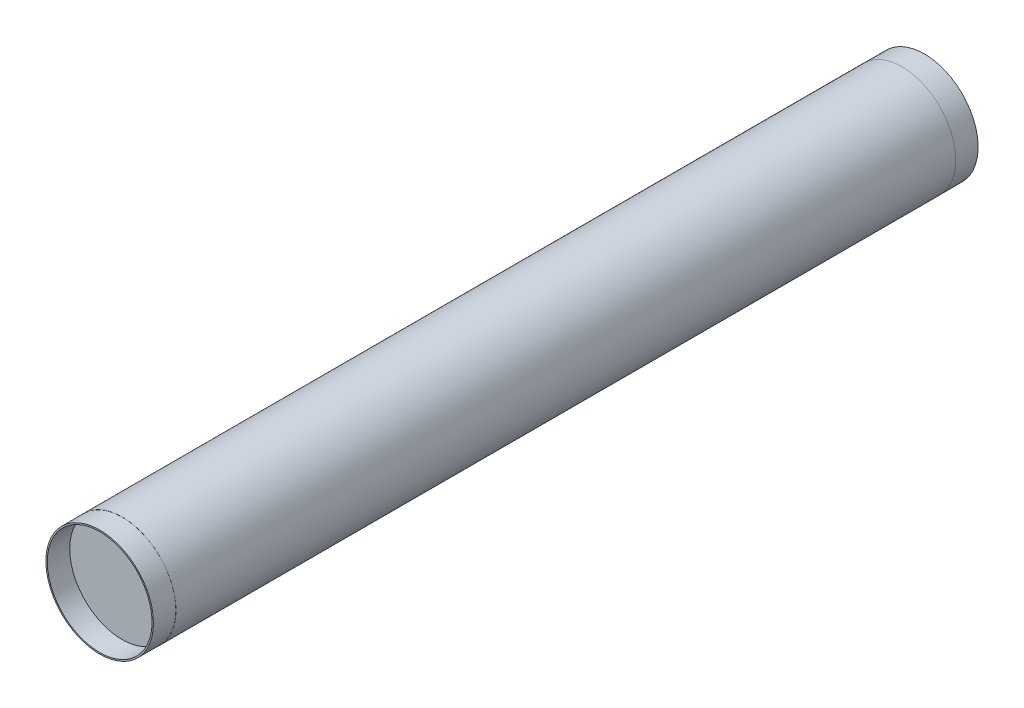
ISO-10303-21;
HEADER;
FILE_DESCRIPTION(('STEP AP214'),'2;1');
FILE_NAME('part.step','',(''),(''),'','','');
FILE_SCHEMA(('AUTOMOTIVE_DESIGN { 1 0 10303 214 1 1 1 1 }'));
ENDSEC;
DATA;
#1=APPLICATION_CONTEXT('core data for automotive mechanical design processes');
#2=APPLICATION_PROTOCOL_DEFINITION('international standard','automotive_design',2000,#1);
#3=PRODUCT_CONTEXT('',#1,'mechanical');
#4=PRODUCT('Part','Part','',(#3));
#5=PRODUCT_RELATED_PRODUCT_CATEGORY('part','',(#4));
#6=PRODUCT_DEFINITION_FORMATION('','',#4);
#7=PRODUCT_DEFINITION_CONTEXT('part definition',#1,'design');
#8=PRODUCT_DEFINITION('design','',#6,#7);
#9=PRODUCT_DEFINITION_SHAPE('','',#8);
#10=(LENGTH_UNIT() NAMED_UNIT(*) SI_UNIT(.MILLI.,.METRE.));
#11=(NAMED_UNIT(*) PLANE_ANGLE_UNIT() SI_UNIT($,.RADIAN.));
#12=(NAMED_UNIT(*) SI_UNIT($,.STERADIAN.) SOLID_ANGLE_UNIT());
#13=UNCERTAINTY_MEASURE_WITH_UNIT(LENGTH_MEASURE(1.E-05),#10,'distance_accuracy_value','');
#14=(GEOMETRIC_REPRESENTATION_CONTEXT(3) GLOBAL_UNCERTAINTY_ASSIGNED_CONTEXT((#13)) GLOBAL_UNIT_ASSIGNED_CONTEXT((#10,
#11,#12)) REPRESENTATION_CONTEXT('',''));
#15=CARTESIAN_POINT('',(0.,0.,0.));
#16=DIRECTION('',(0.,0.,1.));
#17=DIRECTION('',(1.,0.,0.));
#18=AXIS2_PLACEMENT_3D('',#15,#16,#17);
#19=CARTESIAN_POINT('',(0.,0.,609.6));
#20=DIRECTION('',(0.,0.,-1.));
#21=DIRECTION('',(-1.,0.,0.));
#22=AXIS2_PLACEMENT_3D('',#19,#20,#21);
#23=CYLINDRICAL_SURFACE('',#22,76.327);
#24=CARTESIAN_POINT('',(0.,0.,577.85));
#25=DIRECTION('',(0.,0.,1.));
#26=DIRECTION('',(1.,0.,0.));
#27=AXIS2_PLACEMENT_3D('',#24,#25,#26);
#28=CIRCLE('',#27,76.327);
#29=CARTESIAN_POINT('',(-76.327,0.,577.85));
#30=VERTEX_POINT('',#29);
#31=EDGE_CURVE('E124',#30,#30,#28,.T.);
#32=CARTESIAN_POINT('',(0.,0.,-527.05));
#33=DIRECTION('',(0.,0.,-1.));
#34=DIRECTION('',(-1.,0.,0.));
#35=AXIS2_PLACEMENT_3D('',#32,#33,#34);
#36=CIRCLE('',#35,76.327);
#37=CARTESIAN_POINT('',(-76.327,0.,-527.05));
#38=VERTEX_POINT('',#37);
#39=EDGE_CURVE('E115',#38,#38,#36,.T.);
#40=CARTESIAN_POINT('',(-76.327,0.,577.85));
#41=CARTESIAN_POINT('',(-76.327,0.,566.340625));
#42=CARTESIAN_POINT('',(-76.327,0.,554.83125));
#43=CARTESIAN_POINT('',(-76.327,0.,531.8125));
#44=CARTESIAN_POINT('',(-76.327,0.,520.303125));
#45=CARTESIAN_POINT('',(-76.327,0.,497.284375));
#46=CARTESIAN_POINT('',(-76.327,0.,485.775));
#47=CARTESIAN_POINT('',(-76.327,0.,462.75625));
#48=CARTESIAN_POINT('',(-76.327,0.,451.246875));
#49=CARTESIAN_POINT('',(-76.327,0.,428.228125));
#50=CARTESIAN_POINT('',(-76.327,0.,416.71875));
#51=CARTESIAN_POINT('',(-76.327,0.,393.7));
#52=CARTESIAN_POINT('',(-76.327,0.,382.190625));
#53=CARTESIAN_POINT('',(-76.327,0.,359.171875));
#54=CARTESIAN_POINT('',(-76.327,0.,347.6625));
#55=CARTESIAN_POINT('',(-76.327,0.,324.64375));
#56=CARTESIAN_POINT('',(-76.327,0.,313.134375));
#57=CARTESIAN_POINT('',(-76.327,0.,290.115625));
#58=CARTESIAN_POINT('',(-76.327,0.,278.60625));
#59=CARTESIAN_POINT('',(-76.327,0.,255.5875));
#60=CARTESIAN_POINT('',(-76.327,0.,244.078125));
#61=CARTESIAN_POINT('',(-76.327,0.,221.059375));
#62=CARTESIAN_POINT('',(-76.327,0.,209.55));
#63=CARTESIAN_POINT('',(-76.327,0.,186.53125));
#64=CARTESIAN_POINT('',(-76.327,0.,175.021875));
#65=CARTESIAN_POINT('',(-76.327,0.,152.003125));
#66=CARTESIAN_POINT('',(-76.327,0.,140.49375));
#67=CARTESIAN_POINT('',(-76.327,0.,117.475));
#68=CARTESIAN_POINT('',(-76.327,0.,105.965625));
#69=CARTESIAN_POINT('',(-76.327,0.,82.9468749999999));
#70=CARTESIAN_POINT('',(-76.327,0.,71.4374999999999));
#71=CARTESIAN_POINT('',(-76.327,0.,48.4187499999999));
#72=CARTESIAN_POINT('',(-76.327,0.,36.9093749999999));
#73=CARTESIAN_POINT('',(-76.327,0.,13.8906249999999));
#74=CARTESIAN_POINT('',(-76.327,0.,2.38124999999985));
#75=CARTESIAN_POINT('',(-76.327,0.,-20.6375000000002));
#76=CARTESIAN_POINT('',(-76.327,0.,-32.1468750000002));
#77=CARTESIAN_POINT('',(-76.327,0.,-55.1656250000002));
#78=CARTESIAN_POINT('',(-76.327,0.,-66.6750000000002));
#79=CARTESIAN_POINT('',(-76.327,0.,-89.6937500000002));
#80=CARTESIAN_POINT('',(-76.327,0.,-101.203125));
#81=CARTESIAN_POINT('',(-76.327,0.,-124.221875));
#82=CARTESIAN_POINT('',(-76.327,0.,-135.73125));
#83=CARTESIAN_POINT('',(-76.327,0.,-158.75));
#84=CARTESIAN_POINT('',(-76.327,0.,-170.259375));
#85=CARTESIAN_POINT('',(-76.327,0.,-193.278125));
#86=CARTESIAN_POINT('',(-76.327,0.,-204.7875));
#87=CARTESIAN_POINT('',(-76.327,0.,-227.80625));
#88=CARTESIAN_POINT('',(-76.327,0.,-239.315625));
#89=CARTESIAN_POINT('',(-76.327,0.,-262.334375));
#90=CARTESIAN_POINT('',(-76.327,0.,-273.84375));
#91=CARTESIAN_POINT('',(-76.327,0.,-296.8625));
#92=CARTESIAN_POINT('',(-76.327,0.,-308.371875));
#93=CARTESIAN_POINT('',(-76.327,0.,-331.390625));
#94=CARTESIAN_POINT('',(-76.327,0.,-342.9));
#95=CARTESIAN_POINT('',(-76.327,0.,-365.91875));
#96=CARTESIAN_POINT('',(-76.327,0.,-377.428125));
#97=CARTESIAN_POINT('',(-76.327,0.,-400.446875));
#98=CARTESIAN_POINT('',(-76.327,0.,-411.95625));
#99=CARTESIAN_POINT('',(-76.327,0.,-434.975));
#100=CARTESIAN_POINT('',(-76.327,0.,-446.484375));
#101=CARTESIAN_POINT('',(-76.327,0.,-469.503125));
#102=CARTESIAN_POINT('',(-76.327,0.,-481.0125));
#103=CARTESIAN_POINT('',(-76.327,0.,-504.03125));
#104=CARTESIAN_POINT('',(-76.327,0.,-515.540625));
#105=CARTESIAN_POINT('',(-76.327,0.,-527.05));
#106=B_SPLINE_CURVE_WITH_KNOTS('',3,(#40,#41,#42,#43,#44,#45,#46,#47,#48,#49,#50,#51,#52,#53,
#54,#55,#56,#57,#58,#59,#60,#61,#62,#63,#64,#65,#66,#67,#68,#69,#70,#71,#72,#73,#74,#75,#76,#77,
#78,#79,#80,#81,#82,#83,#84,#85,#86,#87,#88,#89,#90,#91,#92,#93,#94,#95,#96,#97,#98,#99,#100,
#101,#102,#103,#104,#105),.UNSPECIFIED.,.F.,.F.,(4,2,2,2,2,2,2,2,2,2,2,2,2,2,2,2,2,2,2,2,2,2,2,
2,2,2,2,2,2,2,2,2,4),(0.,34.5281249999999,69.0562499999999,103.584375,138.1125,172.640625,
207.16875,241.696875,276.225,310.753125,345.28125,379.809375,414.3375,448.865625,483.39375,
517.921875,552.45,586.978125,621.50625,656.034375,690.5625,725.090625,759.61875,794.146875,
828.675,863.203125,897.73125,932.259375,966.7875,1001.315625,1035.84375,1070.371875,1104.9),.UNSPECIFIED.);
#107=EDGE_CURVE('BSEAM112',#30,#38,#106,.T.);
#108=ORIENTED_EDGE('',*,*,#31,.F.);
#109=ORIENTED_EDGE('',*,*,#39,.F.);
#110=ORIENTED_EDGE('',*,*,#107,.T.);
#111=ORIENTED_EDGE('',*,*,#107,.F.);
#112=EDGE_LOOP('',(#108,#110,#109,#111));
#113=FACE_BOUND('',#112,.T.);
#114=ADVANCED_FACE('F112',(#113),#23,.T.);
#115=CARTESIAN_POINT('',(1643.11629233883,116.289931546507,-558.8));
#116=DIRECTION('',(0.,0.,-1.));
#117=DIRECTION('',(-1.,0.,0.));
#118=AXIS2_PLACEMENT_3D('',#115,#116,#117);
#119=PLANE('',#118);
#120=CARTESIAN_POINT('',(0.,0.,-558.8));
#121=DIRECTION('',(0.,0.,-1.));
#122=DIRECTION('',(-1.,0.,0.));
#123=AXIS2_PLACEMENT_3D('',#120,#121,#122);
#124=CIRCLE('',#123,74.2188);
#125=CARTESIAN_POINT('',(-74.2188,0.,-558.8));
#126=VERTEX_POINT('',#125);
#127=EDGE_CURVE('E119',#126,#126,#124,.T.);
#128=ORIENTED_EDGE('',*,*,#127,.F.);
#129=EDGE_LOOP('',(#128));
#130=FACE_BOUND('',#129,.T.);
#131=CARTESIAN_POINT('',(0.,0.,-558.8));
#132=DIRECTION('',(0.,0.,-1.));
#133=DIRECTION('',(-1.,0.,0.));
#134=AXIS2_PLACEMENT_3D('',#131,#132,#133);
#135=CIRCLE('',#134,76.2);
#136=CARTESIAN_POINT('',(-76.2,0.,-558.8));
#137=VERTEX_POINT('',#136);
#138=EDGE_CURVE('E138',#137,#137,#135,.T.);
#139=ORIENTED_EDGE('',*,*,#138,.T.);
#140=EDGE_LOOP('',(#139));
#141=FACE_BOUND('',#140,.T.);
#142=ADVANCED_FACE('F151',(#130,#141),#119,.T.);
#143=CARTESIAN_POINT('',(0.,0.,609.6));
#144=DIRECTION('',(0.,0.,1.));
#145=DIRECTION('',(1.,0.,0.));
#146=AXIS2_PLACEMENT_3D('',#143,#144,#145);
#147=PLANE('',#146);
#148=CARTESIAN_POINT('',(0.,0.,609.6));
#149=DIRECTION('',(0.,0.,1.));
#150=DIRECTION('',(1.,0.,0.));
#151=AXIS2_PLACEMENT_3D('',#148,#149,#150);
#152=CIRCLE('',#151,74.2188);
#153=CARTESIAN_POINT('',(-74.2188,0.,609.6));
#154=VERTEX_POINT('',#153);
#155=EDGE_CURVE('E12',#154,#154,#152,.T.);
#156=ORIENTED_EDGE('',*,*,#155,.F.);
#157=EDGE_LOOP('',(#156));
#158=FACE_BOUND('',#157,.T.);
#159=CARTESIAN_POINT('',(0.,0.,609.6));
#160=DIRECTION('',(0.,0.,1.));
#161=DIRECTION('',(1.,0.,0.));
#162=AXIS2_PLACEMENT_3D('',#159,#160,#161);
#163=CIRCLE('',#162,76.2);
#164=CARTESIAN_POINT('',(76.2,0.,609.6));
#165=VERTEX_POINT('',#164);
#166=EDGE_CURVE('E127',#165,#165,#163,.T.);
#167=ORIENTED_EDGE('',*,*,#166,.T.);
#168=EDGE_LOOP('',(#167));
#169=FACE_BOUND('',#168,.T.);
#170=ADVANCED_FACE('F156',(#158,#169),#147,.T.);
#171=CARTESIAN_POINT('',(0.,0.,609.6));
#172=DIRECTION('',(0.,0.,-1.));
#173=DIRECTION('',(-1.,0.,0.));
#174=AXIS2_PLACEMENT_3D('',#171,#172,#173);
#175=CYLINDRICAL_SURFACE('',#174,74.2188);
#176=CARTESIAN_POINT('',(-74.2188,0.,609.6));
#177=CARTESIAN_POINT('',(-74.2188,0.,597.429166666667));
#178=CARTESIAN_POINT('',(-74.2188,0.,585.258333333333));
#179=CARTESIAN_POINT('',(-74.2188,0.,560.916666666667));
#180=CARTESIAN_POINT('',(-74.2188,0.,548.745833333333));
#181=CARTESIAN_POINT('',(-74.2188,0.,524.404166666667));
#182=CARTESIAN_POINT('',(-74.2188,0.,512.233333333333));
#183=CARTESIAN_POINT('',(-74.2188,0.,487.891666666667));
#184=CARTESIAN_POINT('',(-74.2188,0.,475.720833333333));
#185=CARTESIAN_POINT('',(-74.2188,0.,451.379166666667));
#186=CARTESIAN_POINT('',(-74.2188,0.,439.208333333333));
#187=CARTESIAN_POINT('',(-74.2188,0.,414.866666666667));
#188=CARTESIAN_POINT('',(-74.2188,0.,402.695833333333));
#189=CARTESIAN_POINT('',(-74.2188,0.,378.354166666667));
#190=CARTESIAN_POINT('',(-74.2188,0.,366.183333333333));
#191=CARTESIAN_POINT('',(-74.2188,0.,341.841666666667));
#192=CARTESIAN_POINT('',(-74.2188,0.,329.670833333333));
#193=CARTESIAN_POINT('',(-74.2188,0.,305.329166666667));
#194=CARTESIAN_POINT('',(-74.2188,0.,293.158333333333));
#195=CARTESIAN_POINT('',(-74.2188,0.,268.816666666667));
#196=CARTESIAN_POINT('',(-74.2188,0.,256.645833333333));
#197=CARTESIAN_POINT('',(-74.2188,0.,232.304166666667));
#198=CARTESIAN_POINT('',(-74.2188,0.,220.133333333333));
#199=CARTESIAN_POINT('',(-74.2188,0.,195.791666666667));
#200=CARTESIAN_POINT('',(-74.2188,0.,183.620833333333));
#201=CARTESIAN_POINT('',(-74.2188,0.,159.279166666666));
#202=CARTESIAN_POINT('',(-74.2188,0.,147.108333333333));
#203=CARTESIAN_POINT('',(-74.2188,0.,122.766666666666));
#204=CARTESIAN_POINT('',(-74.2188,0.,110.595833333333));
#205=CARTESIAN_POINT('',(-74.2188,0.,86.2541666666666));
#206=CARTESIAN_POINT('',(-74.2188,0.,74.0833333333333));
#207=CARTESIAN_POINT('',(-74.2188,0.,49.7416666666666));
#208=CARTESIAN_POINT('',(-74.2188,0.,37.5708333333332));
#209=CARTESIAN_POINT('',(-74.2188,0.,13.2291666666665));
#210=CARTESIAN_POINT('',(-74.2188,0.,1.05833333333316));
#211=CARTESIAN_POINT('',(-74.2188,0.,-23.2833333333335));
#212=CARTESIAN_POINT('',(-74.2188,0.,-35.4541666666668));
#213=CARTESIAN_POINT('',(-74.2188,0.,-59.7958333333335));
#214=CARTESIAN_POINT('',(-74.2188,0.,-71.9666666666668));
#215=CARTESIAN_POINT('',(-74.2188,0.,-96.3083333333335));
#216=CARTESIAN_POINT('',(-74.2188,0.,-108.479166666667));
#217=CARTESIAN_POINT('',(-74.2188,0.,-132.820833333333));
#218=CARTESIAN_POINT('',(-74.2188,0.,-144.991666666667));
#219=CARTESIAN_POINT('',(-74.2188,0.,-169.333333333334));
#220=CARTESIAN_POINT('',(-74.2188,0.,-181.504166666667));
#221=CARTESIAN_POINT('',(-74.2188,0.,-205.845833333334));
#222=CARTESIAN_POINT('',(-74.2188,0.,-218.016666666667));
#223=CARTESIAN_POINT('',(-74.2188,0.,-242.358333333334));
#224=CARTESIAN_POINT('',(-74.2188,0.,-254.529166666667));
#225=CARTESIAN_POINT('',(-74.2188,0.,-278.870833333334));
#226=CARTESIAN_POINT('',(-74.2188,0.,-291.041666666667));
#227=CARTESIAN_POINT('',(-74.2188,0.,-315.383333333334));
#228=CARTESIAN_POINT('',(-74.2188,0.,-327.554166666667));
#229=CARTESIAN_POINT('',(-74.2188,0.,-351.895833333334));
#230=CARTESIAN_POINT('',(-74.2188,0.,-364.066666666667));
#231=CARTESIAN_POINT('',(-74.2188,0.,-388.408333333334));
#232=CARTESIAN_POINT('',(-74.2188,0.,-400.579166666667));
#233=CARTESIAN_POINT('',(-74.2188,0.,-424.920833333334));
#234=CARTESIAN_POINT('',(-74.2188,0.,-437.091666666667));
#235=CARTESIAN_POINT('',(-74.2188,0.,-461.433333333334));
#236=CARTESIAN_POINT('',(-74.2188,0.,-473.604166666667));
#237=CARTESIAN_POINT('',(-74.2188,0.,-497.945833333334));
#238=CARTESIAN_POINT('',(-74.2188,0.,-510.116666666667));
#239=CARTESIAN_POINT('',(-74.2188,0.,-534.458333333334));
#240=CARTESIAN_POINT('',(-74.2188,0.,-546.629166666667));
#241=CARTESIAN_POINT('',(-74.2188,0.,-558.8));
#242=B_SPLINE_CURVE_WITH_KNOTS('',3,(#176,#177,#178,#179,#180,#181,#182,#183,#184,#185,#186,
#187,#188,#189,#190,#191,#192,#193,#194,#195,#196,#197,#198,#199,#200,#201,#202,#203,#204,#205,
#206,#207,#208,#209,#210,#211,#212,#213,#214,#215,#216,#217,#218,#219,#220,#221,#222,#223,#224,
#225,#226,#227,#228,#229,#230,#231,#232,#233,#234,#235,#236,#237,#238,#239,#240,#241),
.UNSPECIFIED.,.F.,.F.,(4,2,2,2,2,2,2,2,2,2,2,2,2,2,2,2,2,2,2,2,2,2,2,2,2,2,2,2,2,2,2,2,4),(0.,
36.5125000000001,73.0250000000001,109.5375,146.05,182.5625,219.075,255.5875,292.1,328.6125,
365.125,401.6375,438.15,474.6625,511.175,547.6875,584.2,620.7125,657.225,693.7375,730.25,
766.7625,803.275,839.7875,876.3,912.8125,949.325,985.8375,1022.35,1058.8625,1095.375,1131.8875,
1168.4),.UNSPECIFIED.);
#243=EDGE_CURVE('BSEAM162',#154,#126,#242,.T.);
#244=ORIENTED_EDGE('',*,*,#155,.T.);
#245=ORIENTED_EDGE('',*,*,#127,.T.);
#246=ORIENTED_EDGE('',*,*,#243,.T.);
#247=ORIENTED_EDGE('',*,*,#243,.F.);
#248=EDGE_LOOP('',(#244,#246,#245,#247));
#249=FACE_BOUND('',#248,.T.);
#250=ADVANCED_FACE('F162',(#249),#175,.F.);
#251=CARTESIAN_POINT('',(0.,0.,577.85));
#252=DIRECTION('',(0.,0.,1.));
#253=DIRECTION('',(1.,0.,0.));
#254=AXIS2_PLACEMENT_3D('',#251,#252,#253);
#255=PLANE('',#254);
#256=CARTESIAN_POINT('',(0.,0.,577.85));
#257=DIRECTION('',(0.,0.,1.));
#258=DIRECTION('',(1.,0.,0.));
#259=AXIS2_PLACEMENT_3D('',#256,#257,#258);
#260=CIRCLE('',#259,76.2);
#261=CARTESIAN_POINT('',(76.2,0.,577.85));
#262=VERTEX_POINT('',#261);
#263=EDGE_CURVE('E130',#262,#262,#260,.T.);
#264=ORIENTED_EDGE('',*,*,#263,.F.);
#265=EDGE_LOOP('',(#264));
#266=FACE_BOUND('',#265,.T.);
#267=ORIENTED_EDGE('',*,*,#31,.T.);
#268=EDGE_LOOP('',(#267));
#269=FACE_BOUND('',#268,.T.);
#270=ADVANCED_FACE('F168',(#266,#269),#255,.T.);
#271=CARTESIAN_POINT('',(0.,0.,577.85));
#272=DIRECTION('',(0.,0.,1.));
#273=DIRECTION('',(1.,0.,0.));
#274=AXIS2_PLACEMENT_3D('',#271,#272,#273);
#275=CYLINDRICAL_SURFACE('',#274,76.2);
#276=ORIENTED_EDGE('',*,*,#263,.T.);
#277=EDGE_LOOP('',(#276));
#278=FACE_BOUND('',#277,.T.);
#279=ORIENTED_EDGE('',*,*,#166,.F.);
#280=EDGE_LOOP('',(#279));
#281=FACE_BOUND('',#280,.T.);
#282=ADVANCED_FACE('F174',(#278,#281),#275,.T.);
#283=CARTESIAN_POINT('',(0.,0.,-527.05));
#284=DIRECTION('',(0.,0.,-1.));
#285=DIRECTION('',(-1.,0.,0.));
#286=AXIS2_PLACEMENT_3D('',#283,#284,#285);
#287=PLANE('',#286);
#288=CARTESIAN_POINT('',(0.,0.,-527.05));
#289=DIRECTION('',(0.,0.,-1.));
#290=DIRECTION('',(-1.,0.,0.));
#291=AXIS2_PLACEMENT_3D('',#288,#289,#290);
#292=CIRCLE('',#291,76.2);
#293=CARTESIAN_POINT('',(-76.2,0.,-527.05));
#294=VERTEX_POINT('',#293);
#295=EDGE_CURVE('E141',#294,#294,#292,.T.);
#296=ORIENTED_EDGE('',*,*,#295,.F.);
#297=EDGE_LOOP('',(#296));
#298=FACE_BOUND('',#297,.T.);
#299=ORIENTED_EDGE('',*,*,#39,.T.);
#300=EDGE_LOOP('',(#299));
#301=FACE_BOUND('',#300,.T.);
#302=ADVANCED_FACE('F148',(#298,#301),#287,.T.);
#303=CARTESIAN_POINT('',(0.,0.,-527.05));
#304=DIRECTION('',(0.,0.,-1.));
#305=DIRECTION('',(-1.,0.,0.));
#306=AXIS2_PLACEMENT_3D('',#303,#304,#305);
#307=CYLINDRICAL_SURFACE('',#306,76.2);
#308=ORIENTED_EDGE('',*,*,#295,.T.);
#309=EDGE_LOOP('',(#308));
#310=FACE_BOUND('',#309,.T.);
#311=ORIENTED_EDGE('',*,*,#138,.F.);
#312=EDGE_LOOP('',(#311));
#313=FACE_BOUND('',#312,.T.);
#314=ADVANCED_FACE('F183',(#310,#313),#307,.T.);
#315=CLOSED_SHELL('',(#114,#142,#170,#250,#270,#282,#302,#314));
#316=MANIFOLD_SOLID_BREP('B2',#315);
#317=ADVANCED_BREP_SHAPE_REPRESENTATION('',(#18,#316),#14);
#318=SHAPE_DEFINITION_REPRESENTATION(#9,#317);
ENDSEC;
END-ISO-10303-21;
